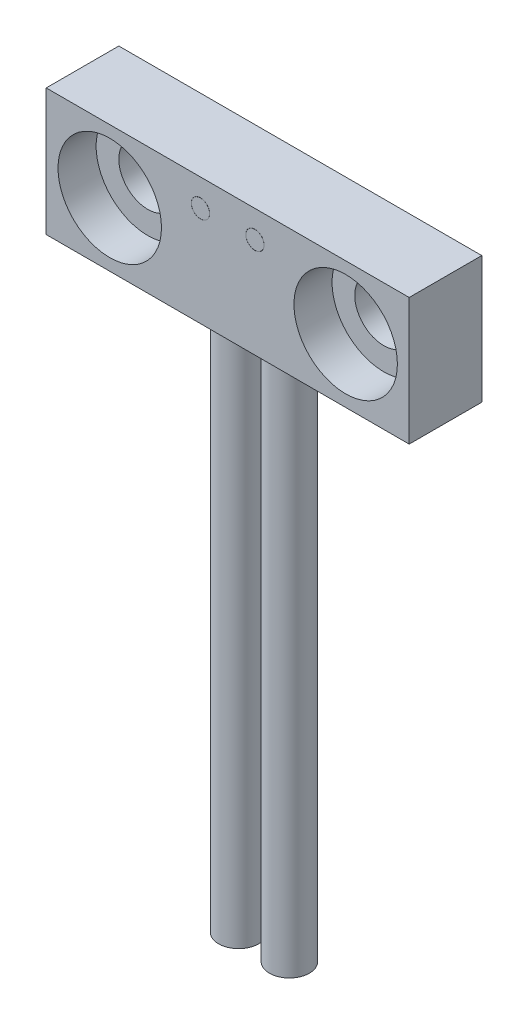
ISO-10303-21;
HEADER;
FILE_DESCRIPTION(('STEP AP214'),'2;1');
FILE_NAME('part.step','',(''),(''),'','','');
FILE_SCHEMA(('AUTOMOTIVE_DESIGN { 1 0 10303 214 1 1 1 1 }'));
ENDSEC;
DATA;
#1=APPLICATION_CONTEXT('core data for automotive mechanical design processes');
#2=APPLICATION_PROTOCOL_DEFINITION('international standard','automotive_design',2000,#1);
#3=PRODUCT_CONTEXT('',#1,'mechanical');
#4=PRODUCT('Part','Part','',(#3));
#5=PRODUCT_RELATED_PRODUCT_CATEGORY('part','',(#4));
#6=PRODUCT_DEFINITION_FORMATION('','',#4);
#7=PRODUCT_DEFINITION_CONTEXT('part definition',#1,'design');
#8=PRODUCT_DEFINITION('design','',#6,#7);
#9=PRODUCT_DEFINITION_SHAPE('','',#8);
#10=(LENGTH_UNIT() NAMED_UNIT(*) SI_UNIT(.MILLI.,.METRE.));
#11=(NAMED_UNIT(*) PLANE_ANGLE_UNIT() SI_UNIT($,.RADIAN.));
#12=(NAMED_UNIT(*) SI_UNIT($,.STERADIAN.) SOLID_ANGLE_UNIT());
#13=UNCERTAINTY_MEASURE_WITH_UNIT(LENGTH_MEASURE(1.E-05),#10,'distance_accuracy_value','');
#14=(GEOMETRIC_REPRESENTATION_CONTEXT(3) GLOBAL_UNCERTAINTY_ASSIGNED_CONTEXT((#13)) GLOBAL_UNIT_ASSIGNED_CONTEXT((#10,
#11,#12)) REPRESENTATION_CONTEXT('',''));
#15=CARTESIAN_POINT('',(0.,0.,0.));
#16=DIRECTION('',(0.,0.,1.));
#17=DIRECTION('',(1.,0.,0.));
#18=AXIS2_PLACEMENT_3D('',#15,#16,#17);
#19=CARTESIAN_POINT('',(-10.,-3.5,2.));
#20=DIRECTION('',(1.,0.,0.));
#21=DIRECTION('',(0.,0.,-1.));
#22=AXIS2_PLACEMENT_3D('',#19,#20,#21);
#23=PLANE('',#22);
#24=DIRECTION('',(0.,-1.,0.));
#25=VECTOR('',#24,1.);
#26=CARTESIAN_POINT('',(-10.,-3.5,-2.));
#27=LINE('',#26,#25);
#28=CARTESIAN_POINT('',(-10.,3.5,-2.));
#29=VERTEX_POINT('',#28);
#30=CARTESIAN_POINT('',(-10.,-3.5,-2.));
#31=VERTEX_POINT('',#30);
#32=EDGE_CURVE('E104',#29,#31,#27,.T.);
#33=ORIENTED_EDGE('',*,*,#32,.T.);
#34=DIRECTION('',(0.,0.,-1.));
#35=VECTOR('',#34,1.);
#36=CARTESIAN_POINT('',(-10.,-3.5,2.));
#37=LINE('',#36,#35);
#38=CARTESIAN_POINT('',(-10.,-3.5,2.));
#39=VERTEX_POINT('',#38);
#40=EDGE_CURVE('E95',#39,#31,#37,.T.);
#41=ORIENTED_EDGE('',*,*,#40,.F.);
#42=DIRECTION('',(0.,-1.,0.));
#43=VECTOR('',#42,1.);
#44=CARTESIAN_POINT('',(-10.,-3.5,2.));
#45=LINE('',#44,#43);
#46=CARTESIAN_POINT('',(-10.,3.5,2.));
#47=VERTEX_POINT('',#46);
#48=EDGE_CURVE('E89',#47,#39,#45,.T.);
#49=ORIENTED_EDGE('',*,*,#48,.F.);
#50=DIRECTION('',(0.,0.,-1.));
#51=VECTOR('',#50,1.);
#52=CARTESIAN_POINT('',(-10.,3.5,2.));
#53=LINE('',#52,#51);
#54=EDGE_CURVE('E100',#47,#29,#53,.T.);
#55=ORIENTED_EDGE('',*,*,#54,.T.);
#56=EDGE_LOOP('',(#33,#41,#49,#55));
#57=FACE_BOUND('',#56,.T.);
#58=ADVANCED_FACE('F37',(#57),#23,.F.);
#59=CARTESIAN_POINT('',(10.,-3.5,2.));
#60=DIRECTION('',(0.,1.,0.));
#61=DIRECTION('',(-1.,0.,0.));
#62=AXIS2_PLACEMENT_3D('',#59,#60,#61);
#63=PLANE('',#62);
#64=CARTESIAN_POINT('',(-1.4,-3.5,0.));
#65=DIRECTION('',(0.,1.,0.));
#66=DIRECTION('',(-1.,0.,0.));
#67=AXIS2_PLACEMENT_3D('',#64,#65,#66);
#68=CIRCLE('',#67,1.1);
#69=CARTESIAN_POINT('',(-2.5,-3.5,0.));
#70=VERTEX_POINT('',#69);
#71=EDGE_CURVE('E11',#70,#70,#68,.F.);
#72=ORIENTED_EDGE('',*,*,#71,.F.);
#73=EDGE_LOOP('',(#72));
#74=FACE_BOUND('',#73,.T.);
#75=CARTESIAN_POINT('',(1.4,-3.5,0.));
#76=DIRECTION('',(0.,1.,0.));
#77=DIRECTION('',(-1.,0.,0.));
#78=AXIS2_PLACEMENT_3D('',#75,#76,#77);
#79=CIRCLE('',#78,1.1);
#80=CARTESIAN_POINT('',(0.3,-3.5,0.));
#81=VERTEX_POINT('',#80);
#82=EDGE_CURVE('E45',#81,#81,#79,.F.);
#83=ORIENTED_EDGE('',*,*,#82,.F.);
#84=EDGE_LOOP('',(#83));
#85=FACE_BOUND('',#84,.T.);
#86=DIRECTION('',(1.,0.,0.));
#87=VECTOR('',#86,1.);
#88=CARTESIAN_POINT('',(10.,-3.5,-2.));
#89=LINE('',#88,#87);
#90=CARTESIAN_POINT('',(10.,-3.5,-2.));
#91=VERTEX_POINT('',#90);
#92=EDGE_CURVE('E94',#31,#91,#89,.T.);
#93=ORIENTED_EDGE('',*,*,#92,.T.);
#94=DIRECTION('',(0.,0.,-1.));
#95=VECTOR('',#94,1.);
#96=CARTESIAN_POINT('',(10.,-3.5,2.));
#97=LINE('',#96,#95);
#98=CARTESIAN_POINT('',(10.,-3.5,2.));
#99=VERTEX_POINT('',#98);
#100=EDGE_CURVE('E92',#99,#91,#97,.T.);
#101=ORIENTED_EDGE('',*,*,#100,.F.);
#102=DIRECTION('',(1.,0.,0.));
#103=VECTOR('',#102,1.);
#104=CARTESIAN_POINT('',(10.,-3.5,2.));
#105=LINE('',#104,#103);
#106=EDGE_CURVE('E84',#39,#99,#105,.T.);
#107=ORIENTED_EDGE('',*,*,#106,.F.);
#108=ORIENTED_EDGE('',*,*,#40,.T.);
#109=EDGE_LOOP('',(#93,#101,#107,#108));
#110=FACE_BOUND('',#109,.T.);
#111=ADVANCED_FACE('F93',(#74,#85,#110),#63,.F.);
#112=CARTESIAN_POINT('',(10.,-3.5,2.));
#113=DIRECTION('',(-1.,0.,0.));
#114=DIRECTION('',(0.,0.,1.));
#115=AXIS2_PLACEMENT_3D('',#112,#113,#114);
#116=PLANE('',#115);
#117=DIRECTION('',(0.,1.,0.));
#118=VECTOR('',#117,1.);
#119=CARTESIAN_POINT('',(10.,-3.5,-2.));
#120=LINE('',#119,#118);
#121=CARTESIAN_POINT('',(10.,3.5,-2.));
#122=VERTEX_POINT('',#121);
#123=EDGE_CURVE('E70',#91,#122,#120,.T.);
#124=ORIENTED_EDGE('',*,*,#123,.T.);
#125=DIRECTION('',(0.,0.,-1.));
#126=VECTOR('',#125,1.);
#127=CARTESIAN_POINT('',(10.,3.5,2.));
#128=LINE('',#127,#126);
#129=CARTESIAN_POINT('',(10.,3.5,2.));
#130=VERTEX_POINT('',#129);
#131=EDGE_CURVE('E96',#130,#122,#128,.T.);
#132=ORIENTED_EDGE('',*,*,#131,.F.);
#133=DIRECTION('',(0.,1.,0.));
#134=VECTOR('',#133,1.);
#135=CARTESIAN_POINT('',(10.,-3.5,2.));
#136=LINE('',#135,#134);
#137=EDGE_CURVE('E87',#99,#130,#136,.T.);
#138=ORIENTED_EDGE('',*,*,#137,.F.);
#139=ORIENTED_EDGE('',*,*,#100,.T.);
#140=EDGE_LOOP('',(#124,#132,#138,#139));
#141=FACE_BOUND('',#140,.T.);
#142=ADVANCED_FACE('F98',(#141),#116,.F.);
#143=CARTESIAN_POINT('',(10.,3.5,2.));
#144=DIRECTION('',(0.,-1.,0.));
#145=DIRECTION('',(1.,0.,0.));
#146=AXIS2_PLACEMENT_3D('',#143,#144,#145);
#147=PLANE('',#146);
#148=DIRECTION('',(-1.,0.,0.));
#149=VECTOR('',#148,1.);
#150=CARTESIAN_POINT('',(10.,3.5,-2.));
#151=LINE('',#150,#149);
#152=EDGE_CURVE('E76',#122,#29,#151,.T.);
#153=ORIENTED_EDGE('',*,*,#152,.T.);
#154=ORIENTED_EDGE('',*,*,#54,.F.);
#155=DIRECTION('',(-1.,0.,0.));
#156=VECTOR('',#155,1.);
#157=CARTESIAN_POINT('',(10.,3.5,2.));
#158=LINE('',#157,#156);
#159=EDGE_CURVE('E53',#130,#47,#158,.T.);
#160=ORIENTED_EDGE('',*,*,#159,.F.);
#161=ORIENTED_EDGE('',*,*,#131,.T.);
#162=EDGE_LOOP('',(#153,#154,#160,#161));
#163=FACE_BOUND('',#162,.T.);
#164=ADVANCED_FACE('F124',(#163),#147,.F.);
#165=CARTESIAN_POINT('',(0.,0.,2.));
#166=DIRECTION('',(0.,0.,1.));
#167=DIRECTION('',(1.,0.,0.));
#168=AXIS2_PLACEMENT_3D('',#165,#166,#167);
#169=PLANE('',#168);
#170=CARTESIAN_POINT('',(-1.5,2.,2.));
#171=DIRECTION('',(0.,0.,1.));
#172=DIRECTION('',(1.,0.,0.));
#173=AXIS2_PLACEMENT_3D('',#170,#171,#172);
#174=CIRCLE('',#173,0.505);
#175=CARTESIAN_POINT('',(-0.995,2.,2.));
#176=VERTEX_POINT('',#175);
#177=EDGE_CURVE('E216',#176,#176,#174,.T.);
#178=ORIENTED_EDGE('',*,*,#177,.F.);
#179=EDGE_LOOP('',(#178));
#180=FACE_BOUND('',#179,.T.);
#181=CARTESIAN_POINT('',(1.5,2.,2.));
#182=DIRECTION('',(0.,0.,1.));
#183=DIRECTION('',(1.,0.,0.));
#184=AXIS2_PLACEMENT_3D('',#181,#182,#183);
#185=CIRCLE('',#184,0.505);
#186=CARTESIAN_POINT('',(2.005,2.,2.));
#187=VERTEX_POINT('',#186);
#188=EDGE_CURVE('E219',#187,#187,#185,.T.);
#189=ORIENTED_EDGE('',*,*,#188,.F.);
#190=EDGE_LOOP('',(#189));
#191=FACE_BOUND('',#190,.T.);
#192=CARTESIAN_POINT('',(-6.5,0.,2.));
#193=DIRECTION('',(0.,0.,1.));
#194=DIRECTION('',(1.,0.,0.));
#195=AXIS2_PLACEMENT_3D('',#192,#193,#194);
#196=CIRCLE('',#195,2.85);
#197=CARTESIAN_POINT('',(-3.65,0.,2.));
#198=VERTEX_POINT('',#197);
#199=EDGE_CURVE('E241',#198,#198,#196,.T.);
#200=ORIENTED_EDGE('',*,*,#199,.F.);
#201=EDGE_LOOP('',(#200));
#202=FACE_BOUND('',#201,.T.);
#203=CARTESIAN_POINT('',(6.5,0.,2.));
#204=DIRECTION('',(0.,0.,1.));
#205=DIRECTION('',(1.,0.,0.));
#206=AXIS2_PLACEMENT_3D('',#203,#204,#205);
#207=CIRCLE('',#206,2.85);
#208=CARTESIAN_POINT('',(9.35,0.,2.));
#209=VERTEX_POINT('',#208);
#210=EDGE_CURVE('E253',#209,#209,#207,.T.);
#211=ORIENTED_EDGE('',*,*,#210,.F.);
#212=EDGE_LOOP('',(#211));
#213=FACE_BOUND('',#212,.T.);
#214=ORIENTED_EDGE('',*,*,#48,.T.);
#215=ORIENTED_EDGE('',*,*,#106,.T.);
#216=ORIENTED_EDGE('',*,*,#137,.T.);
#217=ORIENTED_EDGE('',*,*,#159,.T.);
#218=EDGE_LOOP('',(#214,#215,#216,#217));
#219=FACE_BOUND('',#218,.T.);
#220=ADVANCED_FACE('F85',(#180,#191,#202,#213,#219),#169,.T.);
#221=CARTESIAN_POINT('',(0.,0.,-2.));
#222=DIRECTION('',(0.,0.,1.));
#223=DIRECTION('',(1.,0.,0.));
#224=AXIS2_PLACEMENT_3D('',#221,#222,#223);
#225=PLANE('',#224);
#226=CARTESIAN_POINT('',(-6.5,0.,-2.));
#227=DIRECTION('',(0.,0.,1.));
#228=DIRECTION('',(1.,0.,0.));
#229=AXIS2_PLACEMENT_3D('',#226,#227,#228);
#230=CIRCLE('',#229,1.6);
#231=CARTESIAN_POINT('',(-4.9,0.,-2.));
#232=VERTEX_POINT('',#231);
#233=EDGE_CURVE('E250',#232,#232,#230,.T.);
#234=ORIENTED_EDGE('',*,*,#233,.T.);
#235=EDGE_LOOP('',(#234));
#236=FACE_BOUND('',#235,.T.);
#237=CARTESIAN_POINT('',(6.5,0.,-2.));
#238=DIRECTION('',(0.,0.,1.));
#239=DIRECTION('',(1.,0.,0.));
#240=AXIS2_PLACEMENT_3D('',#237,#238,#239);
#241=CIRCLE('',#240,1.6);
#242=CARTESIAN_POINT('',(8.1,0.,-2.));
#243=VERTEX_POINT('',#242);
#244=EDGE_CURVE('E107',#243,#243,#241,.T.);
#245=ORIENTED_EDGE('',*,*,#244,.T.);
#246=EDGE_LOOP('',(#245));
#247=FACE_BOUND('',#246,.T.);
#248=ORIENTED_EDGE('',*,*,#32,.F.);
#249=ORIENTED_EDGE('',*,*,#152,.F.);
#250=ORIENTED_EDGE('',*,*,#123,.F.);
#251=ORIENTED_EDGE('',*,*,#92,.F.);
#252=EDGE_LOOP('',(#248,#249,#250,#251));
#253=FACE_BOUND('',#252,.T.);
#254=ADVANCED_FACE('F131',(#236,#247,#253),#225,.F.);
#255=CARTESIAN_POINT('',(6.5,0.,2.));
#256=DIRECTION('',(0.,0.,1.));
#257=DIRECTION('',(1.,0.,0.));
#258=AXIS2_PLACEMENT_3D('',#255,#256,#257);
#259=CYLINDRICAL_SURFACE('',#258,1.6);
#260=ORIENTED_EDGE('',*,*,#244,.F.);
#261=EDGE_LOOP('',(#260));
#262=FACE_BOUND('',#261,.T.);
#263=CARTESIAN_POINT('',(6.5,0.,-0.1));
#264=DIRECTION('',(0.,0.,1.));
#265=DIRECTION('',(1.,0.,0.));
#266=AXIS2_PLACEMENT_3D('',#263,#264,#265);
#267=CIRCLE('',#266,1.6);
#268=CARTESIAN_POINT('',(8.1,0.,-0.1));
#269=VERTEX_POINT('',#268);
#270=EDGE_CURVE('E259',#269,#269,#267,.T.);
#271=ORIENTED_EDGE('',*,*,#270,.T.);
#272=EDGE_LOOP('',(#271));
#273=FACE_BOUND('',#272,.T.);
#274=ADVANCED_FACE('F134',(#262,#273),#259,.F.);
#275=CARTESIAN_POINT('',(8.1,0.,-0.1));
#276=DIRECTION('',(0.,0.,-1.));
#277=DIRECTION('',(-1.,0.,0.));
#278=AXIS2_PLACEMENT_3D('',#275,#276,#277);
#279=PLANE('',#278);
#280=ORIENTED_EDGE('',*,*,#270,.F.);
#281=EDGE_LOOP('',(#280));
#282=FACE_BOUND('',#281,.T.);
#283=CARTESIAN_POINT('',(6.5,0.,-0.1));
#284=DIRECTION('',(0.,0.,1.));
#285=DIRECTION('',(1.,0.,0.));
#286=AXIS2_PLACEMENT_3D('',#283,#284,#285);
#287=CIRCLE('',#286,2.85);
#288=CARTESIAN_POINT('',(9.35,0.,-0.1));
#289=VERTEX_POINT('',#288);
#290=EDGE_CURVE('E256',#289,#289,#287,.T.);
#291=ORIENTED_EDGE('',*,*,#290,.T.);
#292=EDGE_LOOP('',(#291));
#293=FACE_BOUND('',#292,.T.);
#294=ADVANCED_FACE('F143',(#282,#293),#279,.F.);
#295=CARTESIAN_POINT('',(6.5,0.,2.));
#296=DIRECTION('',(0.,0.,1.));
#297=DIRECTION('',(1.,0.,0.));
#298=AXIS2_PLACEMENT_3D('',#295,#296,#297);
#299=CYLINDRICAL_SURFACE('',#298,2.85);
#300=ORIENTED_EDGE('',*,*,#290,.F.);
#301=EDGE_LOOP('',(#300));
#302=FACE_BOUND('',#301,.T.);
#303=ORIENTED_EDGE('',*,*,#210,.T.);
#304=EDGE_LOOP('',(#303));
#305=FACE_BOUND('',#304,.T.);
#306=ADVANCED_FACE('F147',(#302,#305),#299,.F.);
#307=CARTESIAN_POINT('',(-6.5,0.,2.));
#308=DIRECTION('',(0.,0.,1.));
#309=DIRECTION('',(1.,0.,0.));
#310=AXIS2_PLACEMENT_3D('',#307,#308,#309);
#311=CYLINDRICAL_SURFACE('',#310,1.6);
#312=ORIENTED_EDGE('',*,*,#233,.F.);
#313=EDGE_LOOP('',(#312));
#314=FACE_BOUND('',#313,.T.);
#315=CARTESIAN_POINT('',(-6.5,0.,-0.1));
#316=DIRECTION('',(0.,0.,1.));
#317=DIRECTION('',(1.,0.,0.));
#318=AXIS2_PLACEMENT_3D('',#315,#316,#317);
#319=CIRCLE('',#318,1.6);
#320=CARTESIAN_POINT('',(-4.9,0.,-0.1));
#321=VERTEX_POINT('',#320);
#322=EDGE_CURVE('E247',#321,#321,#319,.T.);
#323=ORIENTED_EDGE('',*,*,#322,.T.);
#324=EDGE_LOOP('',(#323));
#325=FACE_BOUND('',#324,.T.);
#326=ADVANCED_FACE('F151',(#314,#325),#311,.F.);
#327=CARTESIAN_POINT('',(-4.9,0.,-0.1));
#328=DIRECTION('',(0.,0.,-1.));
#329=DIRECTION('',(-1.,0.,0.));
#330=AXIS2_PLACEMENT_3D('',#327,#328,#329);
#331=PLANE('',#330);
#332=ORIENTED_EDGE('',*,*,#322,.F.);
#333=EDGE_LOOP('',(#332));
#334=FACE_BOUND('',#333,.T.);
#335=CARTESIAN_POINT('',(-6.5,0.,-0.1));
#336=DIRECTION('',(0.,0.,1.));
#337=DIRECTION('',(1.,0.,0.));
#338=AXIS2_PLACEMENT_3D('',#335,#336,#337);
#339=CIRCLE('',#338,2.85);
#340=CARTESIAN_POINT('',(-3.65,0.,-0.1));
#341=VERTEX_POINT('',#340);
#342=EDGE_CURVE('E244',#341,#341,#339,.T.);
#343=ORIENTED_EDGE('',*,*,#342,.T.);
#344=EDGE_LOOP('',(#343));
#345=FACE_BOUND('',#344,.T.);
#346=ADVANCED_FACE('F155',(#334,#345),#331,.F.);
#347=CARTESIAN_POINT('',(-6.5,0.,2.));
#348=DIRECTION('',(0.,0.,1.));
#349=DIRECTION('',(1.,0.,0.));
#350=AXIS2_PLACEMENT_3D('',#347,#348,#349);
#351=CYLINDRICAL_SURFACE('',#350,2.85);
#352=ORIENTED_EDGE('',*,*,#342,.F.);
#353=EDGE_LOOP('',(#352));
#354=FACE_BOUND('',#353,.T.);
#355=ORIENTED_EDGE('',*,*,#199,.T.);
#356=EDGE_LOOP('',(#355));
#357=FACE_BOUND('',#356,.T.);
#358=ADVANCED_FACE('F159',(#354,#357),#351,.F.);
#359=CARTESIAN_POINT('',(1.4,-33.5,0.));
#360=DIRECTION('',(0.,1.,0.));
#361=DIRECTION('',(-1.,0.,0.));
#362=AXIS2_PLACEMENT_3D('',#359,#360,#361);
#363=CYLINDRICAL_SURFACE('',#362,1.1);
#364=CARTESIAN_POINT('',(1.4,-33.5,0.));
#365=DIRECTION('',(0.,-1.,0.));
#366=DIRECTION('',(1.,0.,0.));
#367=AXIS2_PLACEMENT_3D('',#364,#365,#366);
#368=CIRCLE('',#367,1.1);
#369=CARTESIAN_POINT('',(2.5,-33.5,0.));
#370=VERTEX_POINT('',#369);
#371=EDGE_CURVE('E238',#370,#370,#368,.T.);
#372=ORIENTED_EDGE('',*,*,#371,.F.);
#373=EDGE_LOOP('',(#372));
#374=FACE_BOUND('',#373,.T.);
#375=ORIENTED_EDGE('',*,*,#82,.T.);
#376=EDGE_LOOP('',(#375));
#377=FACE_BOUND('',#376,.T.);
#378=ADVANCED_FACE('F116',(#374,#377),#363,.T.);
#379=CARTESIAN_POINT('',(1.4,-33.5,0.));
#380=DIRECTION('',(0.,-1.,0.));
#381=DIRECTION('',(1.,0.,0.));
#382=AXIS2_PLACEMENT_3D('',#379,#380,#381);
#383=PLANE('',#382);
#384=ORIENTED_EDGE('',*,*,#371,.T.);
#385=EDGE_LOOP('',(#384));
#386=FACE_BOUND('',#385,.T.);
#387=ADVANCED_FACE('F166',(#386),#383,.T.);
#388=CARTESIAN_POINT('',(-1.4,-33.5,0.));
#389=DIRECTION('',(0.,1.,0.));
#390=DIRECTION('',(-1.,0.,0.));
#391=AXIS2_PLACEMENT_3D('',#388,#389,#390);
#392=CYLINDRICAL_SURFACE('',#391,1.1);
#393=CARTESIAN_POINT('',(-1.4,-33.5,0.));
#394=DIRECTION('',(0.,-1.,0.));
#395=DIRECTION('',(1.,0.,0.));
#396=AXIS2_PLACEMENT_3D('',#393,#394,#395);
#397=CIRCLE('',#396,1.1);
#398=CARTESIAN_POINT('',(-0.299999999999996,-33.5,0.));
#399=VERTEX_POINT('',#398);
#400=EDGE_CURVE('E225',#399,#399,#397,.T.);
#401=ORIENTED_EDGE('',*,*,#400,.F.);
#402=EDGE_LOOP('',(#401));
#403=FACE_BOUND('',#402,.T.);
#404=ORIENTED_EDGE('',*,*,#71,.T.);
#405=EDGE_LOOP('',(#404));
#406=FACE_BOUND('',#405,.T.);
#407=ADVANCED_FACE('F170',(#403,#406),#392,.T.);
#408=CARTESIAN_POINT('',(-1.4,-33.5,0.));
#409=DIRECTION('',(0.,-1.,0.));
#410=DIRECTION('',(1.,0.,0.));
#411=AXIS2_PLACEMENT_3D('',#408,#409,#410);
#412=PLANE('',#411);
#413=ORIENTED_EDGE('',*,*,#400,.T.);
#414=EDGE_LOOP('',(#413));
#415=FACE_BOUND('',#414,.T.);
#416=ADVANCED_FACE('F174',(#415),#412,.T.);
#417=CARTESIAN_POINT('',(1.5,2.,1.9));
#418=DIRECTION('',(0.,0.,1.));
#419=DIRECTION('',(1.,0.,0.));
#420=AXIS2_PLACEMENT_3D('',#417,#418,#419);
#421=CYLINDRICAL_SURFACE('',#420,0.505);
#422=CARTESIAN_POINT('',(1.5,2.,1.9));
#423=DIRECTION('',(0.,0.,1.));
#424=DIRECTION('',(1.,0.,0.));
#425=AXIS2_PLACEMENT_3D('',#422,#423,#424);
#426=CIRCLE('',#425,0.505);
#427=CARTESIAN_POINT('',(2.005,2.,1.9));
#428=VERTEX_POINT('',#427);
#429=EDGE_CURVE('E214',#428,#428,#426,.T.);
#430=ORIENTED_EDGE('',*,*,#429,.F.);
#431=EDGE_LOOP('',(#430));
#432=FACE_BOUND('',#431,.T.);
#433=ORIENTED_EDGE('',*,*,#188,.T.);
#434=EDGE_LOOP('',(#433));
#435=FACE_BOUND('',#434,.T.);
#436=ADVANCED_FACE('F178',(#432,#435),#421,.F.);
#437=CARTESIAN_POINT('',(1.5,2.,1.9));
#438=DIRECTION('',(0.,0.,1.));
#439=DIRECTION('',(1.,0.,0.));
#440=AXIS2_PLACEMENT_3D('',#437,#438,#439);
#441=PLANE('',#440);
#442=CARTESIAN_POINT('',(1.5,2.,1.9));
#443=DIRECTION('',(0.,0.,1.));
#444=DIRECTION('',(1.,0.,0.));
#445=AXIS2_PLACEMENT_3D('',#442,#443,#444);
#446=CIRCLE('',#445,0.5);
#447=CARTESIAN_POINT('',(2.,2.,1.9));
#448=VERTEX_POINT('',#447);
#449=EDGE_CURVE('E228',#448,#448,#446,.T.);
#450=ORIENTED_EDGE('',*,*,#449,.F.);
#451=EDGE_LOOP('',(#450));
#452=FACE_BOUND('',#451,.T.);
#453=ORIENTED_EDGE('',*,*,#429,.T.);
#454=EDGE_LOOP('',(#453));
#455=FACE_BOUND('',#454,.T.);
#456=ADVANCED_FACE('F182',(#452,#455),#441,.T.);
#457=CARTESIAN_POINT('',(1.5,2.,1.9));
#458=DIRECTION('',(0.,0.,1.));
#459=DIRECTION('',(1.,0.,0.));
#460=AXIS2_PLACEMENT_3D('',#457,#458,#459);
#461=CYLINDRICAL_SURFACE('',#460,0.5);
#462=ORIENTED_EDGE('',*,*,#449,.T.);
#463=EDGE_LOOP('',(#462));
#464=FACE_BOUND('',#463,.T.);
#465=CARTESIAN_POINT('',(1.5,2.,2.));
#466=DIRECTION('',(0.,0.,1.));
#467=DIRECTION('',(1.,0.,0.));
#468=AXIS2_PLACEMENT_3D('',#465,#466,#467);
#469=CIRCLE('',#468,0.5);
#470=CARTESIAN_POINT('',(2.,2.,2.));
#471=VERTEX_POINT('',#470);
#472=EDGE_CURVE('E231',#471,#471,#469,.T.);
#473=ORIENTED_EDGE('',*,*,#472,.F.);
#474=EDGE_LOOP('',(#473));
#475=FACE_BOUND('',#474,.T.);
#476=ADVANCED_FACE('F186',(#464,#475),#461,.T.);
#477=CARTESIAN_POINT('',(-1.5,2.,1.9));
#478=DIRECTION('',(0.,0.,1.));
#479=DIRECTION('',(1.,0.,0.));
#480=AXIS2_PLACEMENT_3D('',#477,#478,#479);
#481=CYLINDRICAL_SURFACE('',#480,0.505);
#482=CARTESIAN_POINT('',(-1.5,2.,1.9));
#483=DIRECTION('',(0.,0.,1.));
#484=DIRECTION('',(1.,0.,0.));
#485=AXIS2_PLACEMENT_3D('',#482,#483,#484);
#486=CIRCLE('',#485,0.505);
#487=CARTESIAN_POINT('',(-0.995,2.,1.9));
#488=VERTEX_POINT('',#487);
#489=EDGE_CURVE('E222',#488,#488,#486,.T.);
#490=ORIENTED_EDGE('',*,*,#489,.F.);
#491=EDGE_LOOP('',(#490));
#492=FACE_BOUND('',#491,.T.);
#493=ORIENTED_EDGE('',*,*,#177,.T.);
#494=EDGE_LOOP('',(#493));
#495=FACE_BOUND('',#494,.T.);
#496=ADVANCED_FACE('F190',(#492,#495),#481,.F.);
#497=CARTESIAN_POINT('',(-1.5,2.,1.9));
#498=DIRECTION('',(0.,0.,1.));
#499=DIRECTION('',(1.,0.,0.));
#500=AXIS2_PLACEMENT_3D('',#497,#498,#499);
#501=PLANE('',#500);
#502=CARTESIAN_POINT('',(-1.5,2.,1.9));
#503=DIRECTION('',(0.,0.,1.));
#504=DIRECTION('',(1.,0.,0.));
#505=AXIS2_PLACEMENT_3D('',#502,#503,#504);
#506=CIRCLE('',#505,0.5);
#507=CARTESIAN_POINT('',(-1.,2.,1.9));
#508=VERTEX_POINT('',#507);
#509=EDGE_CURVE('E209',#508,#508,#506,.T.);
#510=ORIENTED_EDGE('',*,*,#509,.F.);
#511=EDGE_LOOP('',(#510));
#512=FACE_BOUND('',#511,.T.);
#513=ORIENTED_EDGE('',*,*,#489,.T.);
#514=EDGE_LOOP('',(#513));
#515=FACE_BOUND('',#514,.T.);
#516=ADVANCED_FACE('F194',(#512,#515),#501,.T.);
#517=CARTESIAN_POINT('',(-1.5,2.,1.9));
#518=DIRECTION('',(0.,0.,1.));
#519=DIRECTION('',(1.,0.,0.));
#520=AXIS2_PLACEMENT_3D('',#517,#518,#519);
#521=CYLINDRICAL_SURFACE('',#520,0.5);
#522=ORIENTED_EDGE('',*,*,#509,.T.);
#523=EDGE_LOOP('',(#522));
#524=FACE_BOUND('',#523,.T.);
#525=CARTESIAN_POINT('',(-1.5,2.,2.));
#526=DIRECTION('',(0.,0.,1.));
#527=DIRECTION('',(1.,0.,0.));
#528=AXIS2_PLACEMENT_3D('',#525,#526,#527);
#529=CIRCLE('',#528,0.5);
#530=CARTESIAN_POINT('',(-1.,2.,2.));
#531=VERTEX_POINT('',#530);
#532=EDGE_CURVE('E212',#531,#531,#529,.T.);
#533=ORIENTED_EDGE('',*,*,#532,.F.);
#534=EDGE_LOOP('',(#533));
#535=FACE_BOUND('',#534,.T.);
#536=ADVANCED_FACE('F198',(#524,#535),#521,.T.);
#537=ORIENTED_EDGE('',*,*,#472,.T.);
#538=EDGE_LOOP('',(#537));
#539=FACE_BOUND('',#538,.T.);
#540=ADVANCED_FACE('F140',(#539),#169,.T.);
#541=ORIENTED_EDGE('',*,*,#532,.T.);
#542=EDGE_LOOP('',(#541));
#543=FACE_BOUND('',#542,.T.);
#544=ADVANCED_FACE('F139',(#543),#169,.T.);
#545=CLOSED_SHELL('',(#58,#111,#142,#164,#220,#254,#274,#294,#306,#326,#346,#358,#378,#387,#407,
#416,#436,#456,#476,#496,#516,#536,#540,#544));
#546=MANIFOLD_SOLID_BREP('B2',#545);
#547=ADVANCED_BREP_SHAPE_REPRESENTATION('',(#18,#546),#14);
#548=SHAPE_DEFINITION_REPRESENTATION(#9,#547);
ENDSEC;
END-ISO-10303-21;
